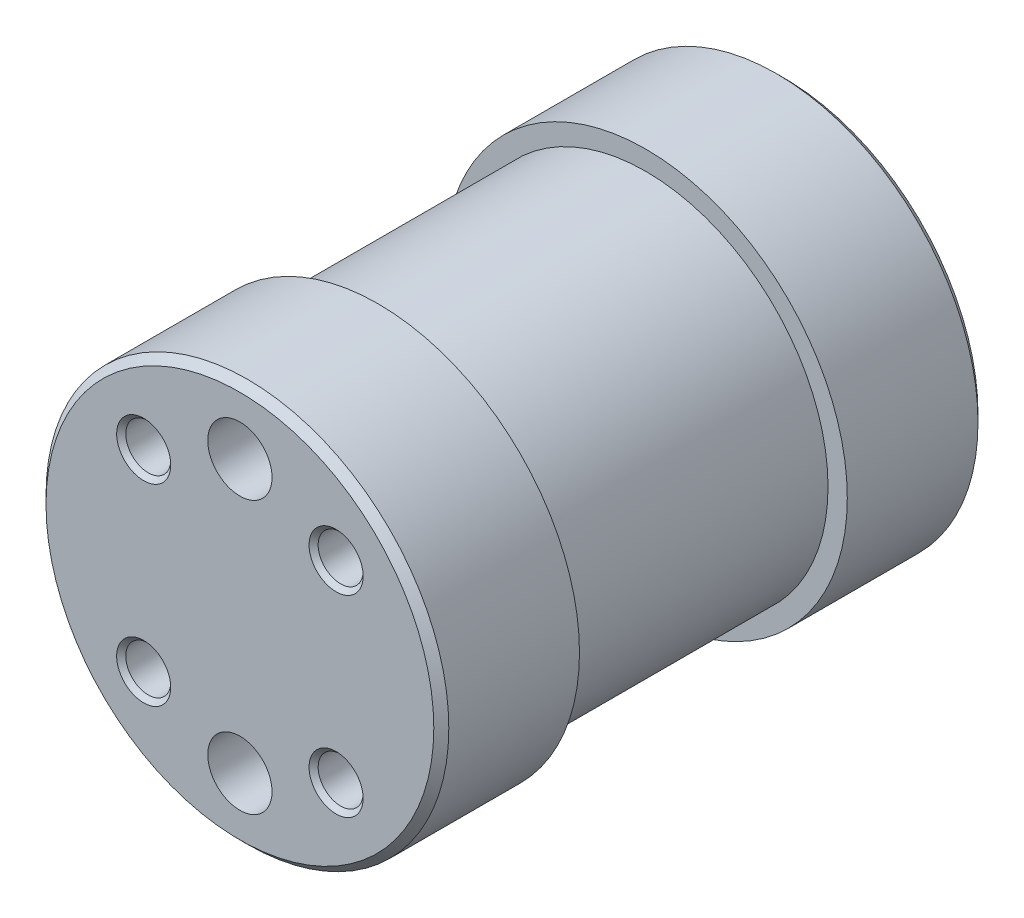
ISO-10303-21;
HEADER;
FILE_DESCRIPTION(('STEP AP214'),'2;1');
FILE_NAME('part.step','',(''),(''),'','','');
FILE_SCHEMA(('AUTOMOTIVE_DESIGN { 1 0 10303 214 1 1 1 1 }'));
ENDSEC;
DATA;
#1=APPLICATION_CONTEXT('core data for automotive mechanical design processes');
#2=APPLICATION_PROTOCOL_DEFINITION('international standard','automotive_design',2000,#1);
#3=PRODUCT_CONTEXT('',#1,'mechanical');
#4=PRODUCT('Part','Part','',(#3));
#5=PRODUCT_RELATED_PRODUCT_CATEGORY('part','',(#4));
#6=PRODUCT_DEFINITION_FORMATION('','',#4);
#7=PRODUCT_DEFINITION_CONTEXT('part definition',#1,'design');
#8=PRODUCT_DEFINITION('design','',#6,#7);
#9=PRODUCT_DEFINITION_SHAPE('','',#8);
#10=(LENGTH_UNIT() NAMED_UNIT(*) SI_UNIT(.MILLI.,.METRE.));
#11=(NAMED_UNIT(*) PLANE_ANGLE_UNIT() SI_UNIT($,.RADIAN.));
#12=(NAMED_UNIT(*) SI_UNIT($,.STERADIAN.) SOLID_ANGLE_UNIT());
#13=UNCERTAINTY_MEASURE_WITH_UNIT(LENGTH_MEASURE(1.E-05),#10,'distance_accuracy_value','');
#14=(GEOMETRIC_REPRESENTATION_CONTEXT(3) GLOBAL_UNCERTAINTY_ASSIGNED_CONTEXT((#13)) GLOBAL_UNIT_ASSIGNED_CONTEXT((#10,
#11,#12)) REPRESENTATION_CONTEXT('',''));
#15=CARTESIAN_POINT('',(0.,0.,0.));
#16=DIRECTION('',(0.,0.,1.));
#17=DIRECTION('',(1.,0.,0.));
#18=AXIS2_PLACEMENT_3D('',#15,#16,#17);
#19=CARTESIAN_POINT('',(18.8,0.,-25.4));
#20=DIRECTION('',(0.,0.,1.));
#21=DIRECTION('',(1.,0.,0.));
#22=AXIS2_PLACEMENT_3D('',#19,#20,#21);
#23=PLANE('',#22);
#24=CARTESIAN_POINT('',(0.,0.,-25.4));
#25=DIRECTION('',(0.,0.,1.));
#26=DIRECTION('',(1.,0.,0.));
#27=AXIS2_PLACEMENT_3D('',#24,#25,#26);
#28=CIRCLE('',#27,18.1);
#29=CARTESIAN_POINT('',(18.1,0.,-25.4));
#30=VERTEX_POINT('',#29);
#31=EDGE_CURVE('E174',#30,#30,#28,.F.);
#32=ORIENTED_EDGE('',*,*,#31,.T.);
#33=EDGE_LOOP('',(#32));
#34=FACE_BOUND('',#33,.T.);
#35=CARTESIAN_POINT('',(-8.9802561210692,-8.98025612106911,-25.4));
#36=DIRECTION('',(0.,0.,-1.));
#37=DIRECTION('',(-1.,0.,0.));
#38=AXIS2_PLACEMENT_3D('',#35,#36,#37);
#39=CIRCLE('',#38,2.525);
#40=CARTESIAN_POINT('',(-11.5052561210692,-8.98025612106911,-25.4));
#41=VERTEX_POINT('',#40);
#42=EDGE_CURVE('E117',#41,#41,#39,.T.);
#43=ORIENTED_EDGE('',*,*,#42,.F.);
#44=EDGE_LOOP('',(#43));
#45=FACE_BOUND('',#44,.T.);
#46=CARTESIAN_POINT('',(-8.98025612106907,8.98025612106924,-25.4));
#47=DIRECTION('',(0.,0.,-1.));
#48=DIRECTION('',(0.,1.,0.));
#49=AXIS2_PLACEMENT_3D('',#46,#47,#48);
#50=CIRCLE('',#49,2.525);
#51=CARTESIAN_POINT('',(-8.98025612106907,11.5052561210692,-25.4));
#52=VERTEX_POINT('',#51);
#53=EDGE_CURVE('E108',#52,#52,#50,.T.);
#54=ORIENTED_EDGE('',*,*,#53,.F.);
#55=EDGE_LOOP('',(#54));
#56=FACE_BOUND('',#55,.T.);
#57=CARTESIAN_POINT('',(8.98025612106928,8.98025612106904,-25.4));
#58=DIRECTION('',(0.,0.,-1.));
#59=DIRECTION('',(0.,1.,0.));
#60=AXIS2_PLACEMENT_3D('',#57,#58,#59);
#61=CIRCLE('',#60,2.525);
#62=CARTESIAN_POINT('',(8.98025612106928,11.505256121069,-25.4));
#63=VERTEX_POINT('',#62);
#64=EDGE_CURVE('E92',#63,#63,#61,.T.);
#65=ORIENTED_EDGE('',*,*,#64,.F.);
#66=EDGE_LOOP('',(#65));
#67=FACE_BOUND('',#66,.T.);
#68=CARTESIAN_POINT('',(8.98025612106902,-8.9802561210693,-25.4));
#69=DIRECTION('',(0.,0.,-1.));
#70=DIRECTION('',(0.,1.,0.));
#71=AXIS2_PLACEMENT_3D('',#68,#69,#70);
#72=CIRCLE('',#71,2.525);
#73=CARTESIAN_POINT('',(8.98025612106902,-6.4552561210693,-25.4));
#74=VERTEX_POINT('',#73);
#75=EDGE_CURVE('E99',#74,#74,#72,.T.);
#76=ORIENTED_EDGE('',*,*,#75,.F.);
#77=EDGE_LOOP('',(#76));
#78=FACE_BOUND('',#77,.T.);
#79=CARTESIAN_POINT('',(0.,-12.7,-25.4));
#80=DIRECTION('',(0.,0.,-1.));
#81=DIRECTION('',(1.,0.,0.));
#82=AXIS2_PLACEMENT_3D('',#79,#80,#81);
#83=CIRCLE('',#82,3.);
#84=CARTESIAN_POINT('',(3.,-12.7,-25.4));
#85=VERTEX_POINT('',#84);
#86=EDGE_CURVE('E345',#85,#85,#83,.T.);
#87=ORIENTED_EDGE('',*,*,#86,.F.);
#88=EDGE_LOOP('',(#87));
#89=FACE_BOUND('',#88,.T.);
#90=CARTESIAN_POINT('',(0.,12.7,-25.4));
#91=DIRECTION('',(0.,0.,1.));
#92=DIRECTION('',(1.,0.,0.));
#93=AXIS2_PLACEMENT_3D('',#90,#91,#92);
#94=CIRCLE('',#93,3.);
#95=CARTESIAN_POINT('',(3.,12.7,-25.4));
#96=VERTEX_POINT('',#95);
#97=EDGE_CURVE('E346',#96,#96,#94,.T.);
#98=ORIENTED_EDGE('',*,*,#97,.T.);
#99=EDGE_LOOP('',(#98));
#100=FACE_BOUND('',#99,.T.);
#101=ADVANCED_FACE('F49',(#34,#45,#56,#67,#78,#89,#100),#23,.F.);
#102=CARTESIAN_POINT('',(0.,0.,25.4));
#103=DIRECTION('',(0.,0.,-1.));
#104=DIRECTION('',(-1.,0.,0.));
#105=AXIS2_PLACEMENT_3D('',#102,#103,#104);
#106=PLANE('',#105);
#107=CARTESIAN_POINT('',(0.,0.,25.4));
#108=DIRECTION('',(0.,0.,-1.));
#109=DIRECTION('',(-1.,0.,0.));
#110=AXIS2_PLACEMENT_3D('',#107,#108,#109);
#111=CIRCLE('',#110,18.1);
#112=CARTESIAN_POINT('',(-18.1,0.,25.4));
#113=VERTEX_POINT('',#112);
#114=EDGE_CURVE('E13',#113,#113,#111,.F.);
#115=ORIENTED_EDGE('',*,*,#114,.T.);
#116=EDGE_LOOP('',(#115));
#117=FACE_BOUND('',#116,.T.);
#118=CARTESIAN_POINT('',(-8.9802561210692,-8.98025612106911,25.4));
#119=DIRECTION('',(0.,0.,1.));
#120=DIRECTION('',(1.,0.,0.));
#121=AXIS2_PLACEMENT_3D('',#118,#119,#120);
#122=CIRCLE('',#121,2.525);
#123=CARTESIAN_POINT('',(-6.4552561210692,-8.98025612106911,25.4));
#124=VERTEX_POINT('',#123);
#125=EDGE_CURVE('E153',#124,#124,#122,.T.);
#126=ORIENTED_EDGE('',*,*,#125,.F.);
#127=EDGE_LOOP('',(#126));
#128=FACE_BOUND('',#127,.T.);
#129=CARTESIAN_POINT('',(-8.98025612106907,8.98025612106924,25.4));
#130=DIRECTION('',(0.,0.,1.));
#131=DIRECTION('',(0.,-1.,0.));
#132=AXIS2_PLACEMENT_3D('',#129,#130,#131);
#133=CIRCLE('',#132,2.525);
#134=CARTESIAN_POINT('',(-8.98025612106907,6.45525612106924,25.4));
#135=VERTEX_POINT('',#134);
#136=EDGE_CURVE('E144',#135,#135,#133,.T.);
#137=ORIENTED_EDGE('',*,*,#136,.F.);
#138=EDGE_LOOP('',(#137));
#139=FACE_BOUND('',#138,.T.);
#140=CARTESIAN_POINT('',(8.98025612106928,8.98025612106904,25.4));
#141=DIRECTION('',(0.,0.,1.));
#142=DIRECTION('',(0.,-1.,0.));
#143=AXIS2_PLACEMENT_3D('',#140,#141,#142);
#144=CIRCLE('',#143,2.525);
#145=CARTESIAN_POINT('',(8.98025612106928,6.45525612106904,25.4));
#146=VERTEX_POINT('',#145);
#147=EDGE_CURVE('E135',#146,#146,#144,.T.);
#148=ORIENTED_EDGE('',*,*,#147,.F.);
#149=EDGE_LOOP('',(#148));
#150=FACE_BOUND('',#149,.T.);
#151=CARTESIAN_POINT('',(8.98025612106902,-8.9802561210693,25.4));
#152=DIRECTION('',(0.,0.,1.));
#153=DIRECTION('',(0.,-1.,0.));
#154=AXIS2_PLACEMENT_3D('',#151,#152,#153);
#155=CIRCLE('',#154,2.525);
#156=CARTESIAN_POINT('',(8.98025612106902,-11.5052561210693,25.4));
#157=VERTEX_POINT('',#156);
#158=EDGE_CURVE('E126',#157,#157,#155,.T.);
#159=ORIENTED_EDGE('',*,*,#158,.F.);
#160=EDGE_LOOP('',(#159));
#161=FACE_BOUND('',#160,.T.);
#162=CARTESIAN_POINT('',(0.,12.7,25.4));
#163=DIRECTION('',(0.,0.,1.));
#164=DIRECTION('',(1.,0.,0.));
#165=AXIS2_PLACEMENT_3D('',#162,#163,#164);
#166=CIRCLE('',#165,3.);
#167=CARTESIAN_POINT('',(3.,12.7,25.4));
#168=VERTEX_POINT('',#167);
#169=EDGE_CURVE('E360',#168,#168,#166,.T.);
#170=ORIENTED_EDGE('',*,*,#169,.F.);
#171=EDGE_LOOP('',(#170));
#172=FACE_BOUND('',#171,.T.);
#173=CARTESIAN_POINT('',(0.,-12.7,25.4));
#174=DIRECTION('',(0.,0.,-1.));
#175=DIRECTION('',(1.,0.,0.));
#176=AXIS2_PLACEMENT_3D('',#173,#174,#175);
#177=CIRCLE('',#176,3.);
#178=CARTESIAN_POINT('',(3.,-12.7,25.4));
#179=VERTEX_POINT('',#178);
#180=EDGE_CURVE('E355',#179,#179,#177,.T.);
#181=ORIENTED_EDGE('',*,*,#180,.T.);
#182=EDGE_LOOP('',(#181));
#183=FACE_BOUND('',#182,.T.);
#184=ADVANCED_FACE('F199',(#117,#128,#139,#150,#161,#172,#183),#106,.F.);
#185=CARTESIAN_POINT('',(0.,0.,-25.4));
#186=DIRECTION('',(0.,0.,-1.));
#187=DIRECTION('',(-1.,0.,0.));
#188=AXIS2_PLACEMENT_3D('',#185,#186,#187);
#189=CYLINDRICAL_SURFACE('',#188,18.8);
#190=CARTESIAN_POINT('',(0.,0.,24.7));
#191=DIRECTION('',(0.,0.,-1.));
#192=DIRECTION('',(-1.,0.,0.));
#193=AXIS2_PLACEMENT_3D('',#190,#191,#192);
#194=CIRCLE('',#193,18.8);
#195=CARTESIAN_POINT('',(-18.8,0.,24.7));
#196=VERTEX_POINT('',#195);
#197=EDGE_CURVE('E57',#196,#196,#194,.T.);
#198=ORIENTED_EDGE('',*,*,#197,.T.);
#199=EDGE_LOOP('',(#198));
#200=FACE_BOUND('',#199,.T.);
#201=CARTESIAN_POINT('',(0.,0.,12.5));
#202=DIRECTION('',(0.,0.,-1.));
#203=DIRECTION('',(-1.,0.,0.));
#204=AXIS2_PLACEMENT_3D('',#201,#202,#203);
#205=CIRCLE('',#204,18.8);
#206=CARTESIAN_POINT('',(-18.8,0.,12.5));
#207=VERTEX_POINT('',#206);
#208=EDGE_CURVE('E171',#207,#207,#205,.T.);
#209=ORIENTED_EDGE('',*,*,#208,.F.);
#210=EDGE_LOOP('',(#209));
#211=FACE_BOUND('',#210,.T.);
#212=ADVANCED_FACE('F182',(#200,#211),#189,.T.);
#213=CARTESIAN_POINT('',(18.8,0.,12.5));
#214=DIRECTION('',(0.,0.,1.));
#215=DIRECTION('',(1.,0.,0.));
#216=AXIS2_PLACEMENT_3D('',#213,#214,#215);
#217=PLANE('',#216);
#218=CARTESIAN_POINT('',(0.,0.,12.5));
#219=DIRECTION('',(0.,0.,-1.));
#220=DIRECTION('',(-1.,0.,0.));
#221=AXIS2_PLACEMENT_3D('',#218,#219,#220);
#222=CIRCLE('',#221,17.);
#223=CARTESIAN_POINT('',(-17.,0.,12.5));
#224=VERTEX_POINT('',#223);
#225=EDGE_CURVE('E168',#224,#224,#222,.T.);
#226=ORIENTED_EDGE('',*,*,#225,.F.);
#227=EDGE_LOOP('',(#226));
#228=FACE_BOUND('',#227,.T.);
#229=ORIENTED_EDGE('',*,*,#208,.T.);
#230=EDGE_LOOP('',(#229));
#231=FACE_BOUND('',#230,.T.);
#232=ADVANCED_FACE('F211',(#228,#231),#217,.F.);
#233=CARTESIAN_POINT('',(0.,0.,-25.4));
#234=DIRECTION('',(0.,0.,-1.));
#235=DIRECTION('',(-1.,0.,0.));
#236=AXIS2_PLACEMENT_3D('',#233,#234,#235);
#237=CYLINDRICAL_SURFACE('',#236,17.);
#238=CARTESIAN_POINT('',(0.,0.,-12.5));
#239=DIRECTION('',(0.,0.,-1.));
#240=DIRECTION('',(-1.,0.,0.));
#241=AXIS2_PLACEMENT_3D('',#238,#239,#240);
#242=CIRCLE('',#241,17.);
#243=CARTESIAN_POINT('',(-17.,0.,-12.5));
#244=VERTEX_POINT('',#243);
#245=EDGE_CURVE('E165',#244,#244,#242,.T.);
#246=ORIENTED_EDGE('',*,*,#245,.F.);
#247=EDGE_LOOP('',(#246));
#248=FACE_BOUND('',#247,.T.);
#249=ORIENTED_EDGE('',*,*,#225,.T.);
#250=EDGE_LOOP('',(#249));
#251=FACE_BOUND('',#250,.T.);
#252=ADVANCED_FACE('F214',(#248,#251),#237,.T.);
#253=CARTESIAN_POINT('',(17.,0.,-12.5));
#254=DIRECTION('',(0.,0.,-1.));
#255=DIRECTION('',(-1.,0.,0.));
#256=AXIS2_PLACEMENT_3D('',#253,#254,#255);
#257=PLANE('',#256);
#258=CARTESIAN_POINT('',(0.,0.,-12.5));
#259=DIRECTION('',(0.,0.,-1.));
#260=DIRECTION('',(-1.,0.,0.));
#261=AXIS2_PLACEMENT_3D('',#258,#259,#260);
#262=CIRCLE('',#261,18.8);
#263=CARTESIAN_POINT('',(-18.8,0.,-12.5));
#264=VERTEX_POINT('',#263);
#265=EDGE_CURVE('E162',#264,#264,#262,.T.);
#266=ORIENTED_EDGE('',*,*,#265,.F.);
#267=EDGE_LOOP('',(#266));
#268=FACE_BOUND('',#267,.T.);
#269=ORIENTED_EDGE('',*,*,#245,.T.);
#270=EDGE_LOOP('',(#269));
#271=FACE_BOUND('',#270,.T.);
#272=ADVANCED_FACE('F218',(#268,#271),#257,.F.);
#273=CARTESIAN_POINT('',(0.,0.,-25.4));
#274=DIRECTION('',(0.,0.,-1.));
#275=DIRECTION('',(-1.,0.,0.));
#276=AXIS2_PLACEMENT_3D('',#273,#274,#275);
#277=CYLINDRICAL_SURFACE('',#276,18.8);
#278=CARTESIAN_POINT('',(0.,0.,-24.7));
#279=DIRECTION('',(0.,0.,1.));
#280=DIRECTION('',(1.,0.,0.));
#281=AXIS2_PLACEMENT_3D('',#278,#279,#280);
#282=CIRCLE('',#281,18.8);
#283=CARTESIAN_POINT('',(18.8,0.,-24.7));
#284=VERTEX_POINT('',#283);
#285=EDGE_CURVE('E177',#284,#284,#282,.T.);
#286=ORIENTED_EDGE('',*,*,#285,.T.);
#287=EDGE_LOOP('',(#286));
#288=FACE_BOUND('',#287,.T.);
#289=ORIENTED_EDGE('',*,*,#265,.T.);
#290=EDGE_LOOP('',(#289));
#291=FACE_BOUND('',#290,.T.);
#292=ADVANCED_FACE('F195',(#288,#291),#277,.T.);
#293=CARTESIAN_POINT('',(0.,0.,-25.4));
#294=DIRECTION('',(0.,0.,1.));
#295=DIRECTION('',(1.,0.,0.));
#296=AXIS2_PLACEMENT_3D('',#293,#294,#295);
#297=CONICAL_SURFACE('',#296,18.1,0.785398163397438);
#298=ORIENTED_EDGE('',*,*,#285,.F.);
#299=EDGE_LOOP('',(#298));
#300=FACE_BOUND('',#299,.T.);
#301=ORIENTED_EDGE('',*,*,#31,.F.);
#302=EDGE_LOOP('',(#301));
#303=FACE_BOUND('',#302,.T.);
#304=ADVANCED_FACE('F187',(#300,#303),#297,.T.);
#305=CARTESIAN_POINT('',(0.,0.,24.7));
#306=DIRECTION('',(0.,0.,-1.));
#307=DIRECTION('',(-1.,0.,0.));
#308=AXIS2_PLACEMENT_3D('',#305,#306,#307);
#309=CONICAL_SURFACE('',#308,18.8,0.785398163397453);
#310=CARTESIAN_POINT('',(-18.1,0.,25.4));
#311=CARTESIAN_POINT('',(-18.1072916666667,0.,25.3927083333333));
#312=CARTESIAN_POINT('',(-18.1145833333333,0.,25.3854166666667));
#313=CARTESIAN_POINT('',(-18.1291666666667,0.,25.3708333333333));
#314=CARTESIAN_POINT('',(-18.1364583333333,0.,25.3635416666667));
#315=CARTESIAN_POINT('',(-18.1510416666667,0.,25.3489583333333));
#316=CARTESIAN_POINT('',(-18.1583333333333,0.,25.3416666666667));
#317=CARTESIAN_POINT('',(-18.1729166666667,0.,25.3270833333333));
#318=CARTESIAN_POINT('',(-18.1802083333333,0.,25.3197916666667));
#319=CARTESIAN_POINT('',(-18.1947916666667,0.,25.3052083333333));
#320=CARTESIAN_POINT('',(-18.2020833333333,0.,25.2979166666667));
#321=CARTESIAN_POINT('',(-18.2166666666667,0.,25.2833333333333));
#322=CARTESIAN_POINT('',(-18.2239583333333,0.,25.2760416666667));
#323=CARTESIAN_POINT('',(-18.2385416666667,0.,25.2614583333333));
#324=CARTESIAN_POINT('',(-18.2458333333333,0.,25.2541666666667));
#325=CARTESIAN_POINT('',(-18.2604166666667,0.,25.2395833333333));
#326=CARTESIAN_POINT('',(-18.2677083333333,0.,25.2322916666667));
#327=CARTESIAN_POINT('',(-18.2822916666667,0.,25.2177083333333));
#328=CARTESIAN_POINT('',(-18.2895833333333,0.,25.2104166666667));
#329=CARTESIAN_POINT('',(-18.3041666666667,0.,25.1958333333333));
#330=CARTESIAN_POINT('',(-18.3114583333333,0.,25.1885416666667));
#331=CARTESIAN_POINT('',(-18.3260416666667,0.,25.1739583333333));
#332=CARTESIAN_POINT('',(-18.3333333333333,0.,25.1666666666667));
#333=CARTESIAN_POINT('',(-18.3479166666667,0.,25.1520833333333));
#334=CARTESIAN_POINT('',(-18.3552083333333,0.,25.1447916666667));
#335=CARTESIAN_POINT('',(-18.3697916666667,0.,25.1302083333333));
#336=CARTESIAN_POINT('',(-18.3770833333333,0.,25.1229166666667));
#337=CARTESIAN_POINT('',(-18.3916666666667,0.,25.1083333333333));
#338=CARTESIAN_POINT('',(-18.3989583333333,0.,25.1010416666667));
#339=CARTESIAN_POINT('',(-18.4135416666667,0.,25.0864583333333));
#340=CARTESIAN_POINT('',(-18.4208333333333,0.,25.0791666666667));
#341=CARTESIAN_POINT('',(-18.4354166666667,0.,25.0645833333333));
#342=CARTESIAN_POINT('',(-18.4427083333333,0.,25.0572916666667));
#343=CARTESIAN_POINT('',(-18.4572916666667,0.,25.0427083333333));
#344=CARTESIAN_POINT('',(-18.4645833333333,0.,25.0354166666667));
#345=CARTESIAN_POINT('',(-18.4791666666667,0.,25.0208333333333));
#346=CARTESIAN_POINT('',(-18.4864583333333,0.,25.0135416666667));
#347=CARTESIAN_POINT('',(-18.5010416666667,0.,24.9989583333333));
#348=CARTESIAN_POINT('',(-18.5083333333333,0.,24.9916666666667));
#349=CARTESIAN_POINT('',(-18.5229166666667,0.,24.9770833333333));
#350=CARTESIAN_POINT('',(-18.5302083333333,0.,24.9697916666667));
#351=CARTESIAN_POINT('',(-18.5447916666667,0.,24.9552083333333));
#352=CARTESIAN_POINT('',(-18.5520833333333,0.,24.9479166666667));
#353=CARTESIAN_POINT('',(-18.5666666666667,0.,24.9333333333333));
#354=CARTESIAN_POINT('',(-18.5739583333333,0.,24.9260416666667));
#355=CARTESIAN_POINT('',(-18.5885416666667,0.,24.9114583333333));
#356=CARTESIAN_POINT('',(-18.5958333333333,0.,24.9041666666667));
#357=CARTESIAN_POINT('',(-18.6104166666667,0.,24.8895833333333));
#358=CARTESIAN_POINT('',(-18.6177083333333,0.,24.8822916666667));
#359=CARTESIAN_POINT('',(-18.6322916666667,0.,24.8677083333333));
#360=CARTESIAN_POINT('',(-18.6395833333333,0.,24.8604166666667));
#361=CARTESIAN_POINT('',(-18.6541666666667,0.,24.8458333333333));
#362=CARTESIAN_POINT('',(-18.6614583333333,0.,24.8385416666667));
#363=CARTESIAN_POINT('',(-18.6760416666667,0.,24.8239583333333));
#364=CARTESIAN_POINT('',(-18.6833333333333,0.,24.8166666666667));
#365=CARTESIAN_POINT('',(-18.6979166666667,0.,24.8020833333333));
#366=CARTESIAN_POINT('',(-18.7052083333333,0.,24.7947916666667));
#367=CARTESIAN_POINT('',(-18.7197916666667,0.,24.7802083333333));
#368=CARTESIAN_POINT('',(-18.7270833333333,0.,24.7729166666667));
#369=CARTESIAN_POINT('',(-18.7416666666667,0.,24.7583333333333));
#370=CARTESIAN_POINT('',(-18.7489583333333,0.,24.7510416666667));
#371=CARTESIAN_POINT('',(-18.7635416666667,0.,24.7364583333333));
#372=CARTESIAN_POINT('',(-18.7708333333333,0.,24.7291666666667));
#373=CARTESIAN_POINT('',(-18.7854166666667,0.,24.7145833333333));
#374=CARTESIAN_POINT('',(-18.7927083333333,0.,24.7072916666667));
#375=CARTESIAN_POINT('',(-18.8,0.,24.7));
#376=B_SPLINE_CURVE_WITH_KNOTS('',3,(#310,#311,#312,#313,#314,#315,#316,#317,#318,#319,#320,
#321,#322,#323,#324,#325,#326,#327,#328,#329,#330,#331,#332,#333,#334,#335,#336,#337,#338,#339,
#340,#341,#342,#343,#344,#345,#346,#347,#348,#349,#350,#351,#352,#353,#354,#355,#356,#357,#358,
#359,#360,#361,#362,#363,#364,#365,#366,#367,#368,#369,#370,#371,#372,#373,#374,#375),
.UNSPECIFIED.,.F.,.F.,(4,2,2,2,2,2,2,2,2,2,2,2,2,2,2,2,2,2,2,2,2,2,2,2,2,2,2,2,2,2,2,2,4),(0.,
0.030935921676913,0.0618718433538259,0.0928077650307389,0.123743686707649,0.15467960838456,
0.185615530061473,0.216551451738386,0.247487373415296,0.278423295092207,0.30935921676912,
0.34029513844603,0.371231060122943,0.402166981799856,0.433102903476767,0.464038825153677,
0.49497474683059,0.525910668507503,0.556846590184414,0.587782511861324,0.618718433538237,
0.64965435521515,0.68059027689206,0.711526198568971,0.742462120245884,0.773398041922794,
0.804333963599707,0.83526988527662,0.866205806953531,0.897141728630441,0.928077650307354,
0.959013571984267,0.989949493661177),.UNSPECIFIED.);
#377=EDGE_CURVE('BSEAM51',#113,#196,#376,.T.);
#378=ORIENTED_EDGE('',*,*,#114,.F.);
#379=ORIENTED_EDGE('',*,*,#197,.F.);
#380=ORIENTED_EDGE('',*,*,#377,.T.);
#381=ORIENTED_EDGE('',*,*,#377,.F.);
#382=EDGE_LOOP('',(#378,#380,#379,#381));
#383=FACE_BOUND('',#382,.T.);
#384=ADVANCED_FACE('F51',(#383),#309,.T.);
#385=CARTESIAN_POINT('',(-8.9802561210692,-8.98025612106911,11.4));
#386=DIRECTION('',(0.,0.,1.));
#387=DIRECTION('',(1.,0.,0.));
#388=AXIS2_PLACEMENT_3D('',#385,#386,#387);
#389=CONICAL_SURFACE('',#388,2.1,1.02974425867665);
#390=CARTESIAN_POINT('',(-8.9802561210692,-8.98025612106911,10.1381927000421));
#391=VERTEX_POINT('',#390);
#392=VERTEX_LOOP('',#391);
#393=FACE_BOUND('',#392,.T.);
#394=CARTESIAN_POINT('',(-8.9802561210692,-8.98025612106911,11.4));
#395=DIRECTION('',(0.,0.,1.));
#396=DIRECTION('',(1.,0.,0.));
#397=AXIS2_PLACEMENT_3D('',#394,#395,#396);
#398=CIRCLE('',#397,2.1);
#399=CARTESIAN_POINT('',(-6.8802561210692,-8.98025612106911,11.4));
#400=VERTEX_POINT('',#399);
#401=EDGE_CURVE('E159',#400,#400,#398,.T.);
#402=ORIENTED_EDGE('',*,*,#401,.T.);
#403=EDGE_LOOP('',(#402));
#404=FACE_BOUND('',#403,.T.);
#405=ADVANCED_FACE('F186',(#393,#404),#389,.F.);
#406=CARTESIAN_POINT('',(-8.9802561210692,-8.98025612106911,25.4));
#407=DIRECTION('',(0.,0.,1.));
#408=DIRECTION('',(1.,0.,0.));
#409=AXIS2_PLACEMENT_3D('',#406,#407,#408);
#410=CYLINDRICAL_SURFACE('',#409,2.1);
#411=ORIENTED_EDGE('',*,*,#401,.F.);
#412=EDGE_LOOP('',(#411));
#413=FACE_BOUND('',#412,.T.);
#414=CARTESIAN_POINT('',(-8.9802561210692,-8.98025612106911,24.975));
#415=DIRECTION('',(0.,0.,1.));
#416=DIRECTION('',(1.,0.,0.));
#417=AXIS2_PLACEMENT_3D('',#414,#415,#416);
#418=CIRCLE('',#417,2.1);
#419=CARTESIAN_POINT('',(-6.8802561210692,-8.98025612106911,24.975));
#420=VERTEX_POINT('',#419);
#421=EDGE_CURVE('E156',#420,#420,#418,.T.);
#422=ORIENTED_EDGE('',*,*,#421,.T.);
#423=EDGE_LOOP('',(#422));
#424=FACE_BOUND('',#423,.T.);
#425=ADVANCED_FACE('F193',(#413,#424),#410,.F.);
#426=CARTESIAN_POINT('',(-8.9802561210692,-8.98025612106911,25.4));
#427=DIRECTION('',(0.,0.,1.));
#428=DIRECTION('',(1.,0.,0.));
#429=AXIS2_PLACEMENT_3D('',#426,#427,#428);
#430=CONICAL_SURFACE('',#429,2.525,0.78539816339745);
#431=ORIENTED_EDGE('',*,*,#421,.F.);
#432=EDGE_LOOP('',(#431));
#433=FACE_BOUND('',#432,.T.);
#434=ORIENTED_EDGE('',*,*,#125,.T.);
#435=EDGE_LOOP('',(#434));
#436=FACE_BOUND('',#435,.T.);
#437=ADVANCED_FACE('F228',(#433,#436),#430,.F.);
#438=CARTESIAN_POINT('',(-8.98025612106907,8.98025612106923,11.4));
#439=DIRECTION('',(0.,0.,1.));
#440=DIRECTION('',(0.,-1.,0.));
#441=AXIS2_PLACEMENT_3D('',#438,#439,#440);
#442=CONICAL_SURFACE('',#441,2.1,1.02974425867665);
#443=CARTESIAN_POINT('',(-8.98025612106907,8.98025612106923,10.1381927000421));
#444=VERTEX_POINT('',#443);
#445=VERTEX_LOOP('',#444);
#446=FACE_BOUND('',#445,.T.);
#447=CARTESIAN_POINT('',(-8.98025612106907,8.98025612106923,11.4));
#448=DIRECTION('',(0.,0.,1.));
#449=DIRECTION('',(0.,-1.,0.));
#450=AXIS2_PLACEMENT_3D('',#447,#448,#449);
#451=CIRCLE('',#450,2.1);
#452=CARTESIAN_POINT('',(-8.98025612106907,6.88025612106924,11.4));
#453=VERTEX_POINT('',#452);
#454=EDGE_CURVE('E150',#453,#453,#451,.T.);
#455=ORIENTED_EDGE('',*,*,#454,.T.);
#456=EDGE_LOOP('',(#455));
#457=FACE_BOUND('',#456,.T.);
#458=ADVANCED_FACE('F232',(#446,#457),#442,.F.);
#459=CARTESIAN_POINT('',(-8.98025612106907,8.98025612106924,25.4));
#460=DIRECTION('',(0.,0.,1.));
#461=DIRECTION('',(0.,-1.,0.));
#462=AXIS2_PLACEMENT_3D('',#459,#460,#461);
#463=CYLINDRICAL_SURFACE('',#462,2.1);
#464=ORIENTED_EDGE('',*,*,#454,.F.);
#465=EDGE_LOOP('',(#464));
#466=FACE_BOUND('',#465,.T.);
#467=CARTESIAN_POINT('',(-8.98025612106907,8.98025612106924,24.975));
#468=DIRECTION('',(0.,0.,1.));
#469=DIRECTION('',(0.,-1.,0.));
#470=AXIS2_PLACEMENT_3D('',#467,#468,#469);
#471=CIRCLE('',#470,2.1);
#472=CARTESIAN_POINT('',(-8.98025612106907,6.88025612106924,24.975));
#473=VERTEX_POINT('',#472);
#474=EDGE_CURVE('E147',#473,#473,#471,.T.);
#475=ORIENTED_EDGE('',*,*,#474,.T.);
#476=EDGE_LOOP('',(#475));
#477=FACE_BOUND('',#476,.T.);
#478=ADVANCED_FACE('F236',(#466,#477),#463,.F.);
#479=CARTESIAN_POINT('',(-8.98025612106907,8.98025612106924,25.4));
#480=DIRECTION('',(0.,0.,1.));
#481=DIRECTION('',(0.,-1.,0.));
#482=AXIS2_PLACEMENT_3D('',#479,#480,#481);
#483=CONICAL_SURFACE('',#482,2.525,0.78539816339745);
#484=ORIENTED_EDGE('',*,*,#474,.F.);
#485=EDGE_LOOP('',(#484));
#486=FACE_BOUND('',#485,.T.);
#487=ORIENTED_EDGE('',*,*,#136,.T.);
#488=EDGE_LOOP('',(#487));
#489=FACE_BOUND('',#488,.T.);
#490=ADVANCED_FACE('F239',(#486,#489),#483,.F.);
#491=CARTESIAN_POINT('',(8.98025612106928,8.98025612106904,11.4));
#492=DIRECTION('',(0.,0.,1.));
#493=DIRECTION('',(0.,-1.,0.));
#494=AXIS2_PLACEMENT_3D('',#491,#492,#493);
#495=CONICAL_SURFACE('',#494,2.1,1.02974425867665);
#496=CARTESIAN_POINT('',(8.98025612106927,8.98025612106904,10.1381927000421));
#497=VERTEX_POINT('',#496);
#498=VERTEX_LOOP('',#497);
#499=FACE_BOUND('',#498,.T.);
#500=CARTESIAN_POINT('',(8.98025612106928,8.98025612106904,11.4));
#501=DIRECTION('',(0.,0.,1.));
#502=DIRECTION('',(0.,-1.,0.));
#503=AXIS2_PLACEMENT_3D('',#500,#501,#502);
#504=CIRCLE('',#503,2.1);
#505=CARTESIAN_POINT('',(8.98025612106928,6.88025612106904,11.4));
#506=VERTEX_POINT('',#505);
#507=EDGE_CURVE('E141',#506,#506,#504,.T.);
#508=ORIENTED_EDGE('',*,*,#507,.T.);
#509=EDGE_LOOP('',(#508));
#510=FACE_BOUND('',#509,.T.);
#511=ADVANCED_FACE('F243',(#499,#510),#495,.F.);
#512=CARTESIAN_POINT('',(8.98025612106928,8.98025612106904,25.4));
#513=DIRECTION('',(0.,0.,1.));
#514=DIRECTION('',(0.,-1.,0.));
#515=AXIS2_PLACEMENT_3D('',#512,#513,#514);
#516=CYLINDRICAL_SURFACE('',#515,2.1);
#517=ORIENTED_EDGE('',*,*,#507,.F.);
#518=EDGE_LOOP('',(#517));
#519=FACE_BOUND('',#518,.T.);
#520=CARTESIAN_POINT('',(8.98025612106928,8.98025612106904,24.975));
#521=DIRECTION('',(0.,0.,1.));
#522=DIRECTION('',(0.,-1.,0.));
#523=AXIS2_PLACEMENT_3D('',#520,#521,#522);
#524=CIRCLE('',#523,2.1);
#525=CARTESIAN_POINT('',(8.98025612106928,6.88025612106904,24.975));
#526=VERTEX_POINT('',#525);
#527=EDGE_CURVE('E138',#526,#526,#524,.T.);
#528=ORIENTED_EDGE('',*,*,#527,.T.);
#529=EDGE_LOOP('',(#528));
#530=FACE_BOUND('',#529,.T.);
#531=ADVANCED_FACE('F247',(#519,#530),#516,.F.);
#532=CARTESIAN_POINT('',(8.98025612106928,8.98025612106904,25.4));
#533=DIRECTION('',(0.,0.,1.));
#534=DIRECTION('',(0.,-1.,0.));
#535=AXIS2_PLACEMENT_3D('',#532,#533,#534);
#536=CONICAL_SURFACE('',#535,2.525,0.78539816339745);
#537=ORIENTED_EDGE('',*,*,#527,.F.);
#538=EDGE_LOOP('',(#537));
#539=FACE_BOUND('',#538,.T.);
#540=ORIENTED_EDGE('',*,*,#147,.T.);
#541=EDGE_LOOP('',(#540));
#542=FACE_BOUND('',#541,.T.);
#543=ADVANCED_FACE('F251',(#539,#542),#536,.F.);
#544=CARTESIAN_POINT('',(8.98025612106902,-8.9802561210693,11.4));
#545=DIRECTION('',(0.,0.,1.));
#546=DIRECTION('',(0.,-1.,0.));
#547=AXIS2_PLACEMENT_3D('',#544,#545,#546);
#548=CONICAL_SURFACE('',#547,2.1,1.02974425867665);
#549=CARTESIAN_POINT('',(8.98025612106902,-8.98025612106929,10.1381927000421));
#550=VERTEX_POINT('',#549);
#551=VERTEX_LOOP('',#550);
#552=FACE_BOUND('',#551,.T.);
#553=CARTESIAN_POINT('',(8.98025612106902,-8.9802561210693,11.4));
#554=DIRECTION('',(0.,0.,1.));
#555=DIRECTION('',(0.,-1.,0.));
#556=AXIS2_PLACEMENT_3D('',#553,#554,#555);
#557=CIRCLE('',#556,2.1);
#558=CARTESIAN_POINT('',(8.98025612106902,-11.0802561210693,11.4));
#559=VERTEX_POINT('',#558);
#560=EDGE_CURVE('E132',#559,#559,#557,.T.);
#561=ORIENTED_EDGE('',*,*,#560,.T.);
#562=EDGE_LOOP('',(#561));
#563=FACE_BOUND('',#562,.T.);
#564=ADVANCED_FACE('F255',(#552,#563),#548,.F.);
#565=CARTESIAN_POINT('',(8.98025612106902,-8.9802561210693,25.4));
#566=DIRECTION('',(0.,0.,1.));
#567=DIRECTION('',(0.,-1.,0.));
#568=AXIS2_PLACEMENT_3D('',#565,#566,#567);
#569=CYLINDRICAL_SURFACE('',#568,2.1);
#570=ORIENTED_EDGE('',*,*,#560,.F.);
#571=EDGE_LOOP('',(#570));
#572=FACE_BOUND('',#571,.T.);
#573=CARTESIAN_POINT('',(8.98025612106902,-8.9802561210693,24.975));
#574=DIRECTION('',(0.,0.,1.));
#575=DIRECTION('',(0.,-1.,0.));
#576=AXIS2_PLACEMENT_3D('',#573,#574,#575);
#577=CIRCLE('',#576,2.1);
#578=CARTESIAN_POINT('',(8.98025612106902,-11.0802561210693,24.975));
#579=VERTEX_POINT('',#578);
#580=EDGE_CURVE('E129',#579,#579,#577,.T.);
#581=ORIENTED_EDGE('',*,*,#580,.T.);
#582=EDGE_LOOP('',(#581));
#583=FACE_BOUND('',#582,.T.);
#584=ADVANCED_FACE('F259',(#572,#583),#569,.F.);
#585=CARTESIAN_POINT('',(8.98025612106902,-8.9802561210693,25.4));
#586=DIRECTION('',(0.,0.,1.));
#587=DIRECTION('',(0.,-1.,0.));
#588=AXIS2_PLACEMENT_3D('',#585,#586,#587);
#589=CONICAL_SURFACE('',#588,2.525,0.78539816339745);
#590=ORIENTED_EDGE('',*,*,#580,.F.);
#591=EDGE_LOOP('',(#590));
#592=FACE_BOUND('',#591,.T.);
#593=ORIENTED_EDGE('',*,*,#158,.T.);
#594=EDGE_LOOP('',(#593));
#595=FACE_BOUND('',#594,.T.);
#596=ADVANCED_FACE('F263',(#592,#595),#589,.F.);
#597=CARTESIAN_POINT('',(-8.9802561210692,-8.98025612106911,-11.4));
#598=DIRECTION('',(0.,0.,-1.));
#599=DIRECTION('',(-1.,0.,0.));
#600=AXIS2_PLACEMENT_3D('',#597,#598,#599);
#601=CONICAL_SURFACE('',#600,2.1,1.02974425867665);
#602=CARTESIAN_POINT('',(-8.9802561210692,-8.98025612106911,-10.1381927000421));
#603=VERTEX_POINT('',#602);
#604=VERTEX_LOOP('',#603);
#605=FACE_BOUND('',#604,.T.);
#606=CARTESIAN_POINT('',(-8.9802561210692,-8.98025612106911,-11.4));
#607=DIRECTION('',(0.,0.,-1.));
#608=DIRECTION('',(-1.,0.,0.));
#609=AXIS2_PLACEMENT_3D('',#606,#607,#608);
#610=CIRCLE('',#609,2.1);
#611=CARTESIAN_POINT('',(-11.0802561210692,-8.98025612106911,-11.4));
#612=VERTEX_POINT('',#611);
#613=EDGE_CURVE('E123',#612,#612,#610,.T.);
#614=ORIENTED_EDGE('',*,*,#613,.T.);
#615=EDGE_LOOP('',(#614));
#616=FACE_BOUND('',#615,.T.);
#617=ADVANCED_FACE('F267',(#605,#616),#601,.F.);
#618=CARTESIAN_POINT('',(-8.9802561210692,-8.98025612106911,-25.4));
#619=DIRECTION('',(0.,0.,-1.));
#620=DIRECTION('',(-1.,0.,0.));
#621=AXIS2_PLACEMENT_3D('',#618,#619,#620);
#622=CYLINDRICAL_SURFACE('',#621,2.1);
#623=ORIENTED_EDGE('',*,*,#613,.F.);
#624=EDGE_LOOP('',(#623));
#625=FACE_BOUND('',#624,.T.);
#626=CARTESIAN_POINT('',(-8.9802561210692,-8.98025612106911,-24.975));
#627=DIRECTION('',(0.,0.,-1.));
#628=DIRECTION('',(-1.,0.,0.));
#629=AXIS2_PLACEMENT_3D('',#626,#627,#628);
#630=CIRCLE('',#629,2.1);
#631=CARTESIAN_POINT('',(-11.0802561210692,-8.98025612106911,-24.975));
#632=VERTEX_POINT('',#631);
#633=EDGE_CURVE('E120',#632,#632,#630,.T.);
#634=ORIENTED_EDGE('',*,*,#633,.T.);
#635=EDGE_LOOP('',(#634));
#636=FACE_BOUND('',#635,.T.);
#637=ADVANCED_FACE('F271',(#625,#636),#622,.F.);
#638=CARTESIAN_POINT('',(-8.9802561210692,-8.98025612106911,-25.4));
#639=DIRECTION('',(0.,0.,-1.));
#640=DIRECTION('',(-1.,0.,0.));
#641=AXIS2_PLACEMENT_3D('',#638,#639,#640);
#642=CONICAL_SURFACE('',#641,2.525,0.78539816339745);
#643=ORIENTED_EDGE('',*,*,#633,.F.);
#644=EDGE_LOOP('',(#643));
#645=FACE_BOUND('',#644,.T.);
#646=ORIENTED_EDGE('',*,*,#42,.T.);
#647=EDGE_LOOP('',(#646));
#648=FACE_BOUND('',#647,.T.);
#649=ADVANCED_FACE('F275',(#645,#648),#642,.F.);
#650=CARTESIAN_POINT('',(-8.98025612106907,8.98025612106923,-11.4));
#651=DIRECTION('',(0.,0.,-1.));
#652=DIRECTION('',(0.,1.,0.));
#653=AXIS2_PLACEMENT_3D('',#650,#651,#652);
#654=CONICAL_SURFACE('',#653,2.1,1.02974425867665);
#655=CARTESIAN_POINT('',(-8.98025612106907,8.98025612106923,-10.1381927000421));
#656=VERTEX_POINT('',#655);
#657=VERTEX_LOOP('',#656);
#658=FACE_BOUND('',#657,.T.);
#659=CARTESIAN_POINT('',(-8.98025612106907,8.98025612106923,-11.4));
#660=DIRECTION('',(0.,0.,-1.));
#661=DIRECTION('',(0.,1.,0.));
#662=AXIS2_PLACEMENT_3D('',#659,#660,#661);
#663=CIRCLE('',#662,2.1);
#664=CARTESIAN_POINT('',(-8.98025612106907,11.0802561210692,-11.4));
#665=VERTEX_POINT('',#664);
#666=EDGE_CURVE('E114',#665,#665,#663,.T.);
#667=ORIENTED_EDGE('',*,*,#666,.T.);
#668=EDGE_LOOP('',(#667));
#669=FACE_BOUND('',#668,.T.);
#670=ADVANCED_FACE('F279',(#658,#669),#654,.F.);
#671=CARTESIAN_POINT('',(-8.98025612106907,8.98025612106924,-25.4));
#672=DIRECTION('',(0.,0.,-1.));
#673=DIRECTION('',(0.,1.,0.));
#674=AXIS2_PLACEMENT_3D('',#671,#672,#673);
#675=CYLINDRICAL_SURFACE('',#674,2.1);
#676=ORIENTED_EDGE('',*,*,#666,.F.);
#677=EDGE_LOOP('',(#676));
#678=FACE_BOUND('',#677,.T.);
#679=CARTESIAN_POINT('',(-8.98025612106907,8.98025612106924,-24.975));
#680=DIRECTION('',(0.,0.,-1.));
#681=DIRECTION('',(0.,1.,0.));
#682=AXIS2_PLACEMENT_3D('',#679,#680,#681);
#683=CIRCLE('',#682,2.1);
#684=CARTESIAN_POINT('',(-8.98025612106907,11.0802561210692,-24.975));
#685=VERTEX_POINT('',#684);
#686=EDGE_CURVE('E111',#685,#685,#683,.T.);
#687=ORIENTED_EDGE('',*,*,#686,.T.);
#688=EDGE_LOOP('',(#687));
#689=FACE_BOUND('',#688,.T.);
#690=ADVANCED_FACE('F283',(#678,#689),#675,.F.);
#691=CARTESIAN_POINT('',(-8.98025612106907,8.98025612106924,-25.4));
#692=DIRECTION('',(0.,0.,-1.));
#693=DIRECTION('',(0.,1.,0.));
#694=AXIS2_PLACEMENT_3D('',#691,#692,#693);
#695=CONICAL_SURFACE('',#694,2.525,0.78539816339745);
#696=ORIENTED_EDGE('',*,*,#686,.F.);
#697=EDGE_LOOP('',(#696));
#698=FACE_BOUND('',#697,.T.);
#699=ORIENTED_EDGE('',*,*,#53,.T.);
#700=EDGE_LOOP('',(#699));
#701=FACE_BOUND('',#700,.T.);
#702=ADVANCED_FACE('F287',(#698,#701),#695,.F.);
#703=CARTESIAN_POINT('',(8.98025612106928,8.98025612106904,-11.4));
#704=DIRECTION('',(0.,0.,-1.));
#705=DIRECTION('',(0.,1.,0.));
#706=AXIS2_PLACEMENT_3D('',#703,#704,#705);
#707=CONICAL_SURFACE('',#706,2.1,1.02974425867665);
#708=CARTESIAN_POINT('',(8.98025612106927,8.98025612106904,-10.1381927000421));
#709=VERTEX_POINT('',#708);
#710=VERTEX_LOOP('',#709);
#711=FACE_BOUND('',#710,.T.);
#712=CARTESIAN_POINT('',(8.98025612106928,8.98025612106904,-11.4));
#713=DIRECTION('',(0.,0.,-1.));
#714=DIRECTION('',(0.,1.,0.));
#715=AXIS2_PLACEMENT_3D('',#712,#713,#714);
#716=CIRCLE('',#715,2.1);
#717=CARTESIAN_POINT('',(8.98025612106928,11.080256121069,-11.4));
#718=VERTEX_POINT('',#717);
#719=EDGE_CURVE('E105',#718,#718,#716,.T.);
#720=ORIENTED_EDGE('',*,*,#719,.T.);
#721=EDGE_LOOP('',(#720));
#722=FACE_BOUND('',#721,.T.);
#723=ADVANCED_FACE('F291',(#711,#722),#707,.F.);
#724=CARTESIAN_POINT('',(8.98025612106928,8.98025612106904,-25.4));
#725=DIRECTION('',(0.,0.,-1.));
#726=DIRECTION('',(0.,1.,0.));
#727=AXIS2_PLACEMENT_3D('',#724,#725,#726);
#728=CYLINDRICAL_SURFACE('',#727,2.1);
#729=ORIENTED_EDGE('',*,*,#719,.F.);
#730=EDGE_LOOP('',(#729));
#731=FACE_BOUND('',#730,.T.);
#732=CARTESIAN_POINT('',(8.98025612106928,8.98025612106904,-24.975));
#733=DIRECTION('',(0.,0.,-1.));
#734=DIRECTION('',(0.,1.,0.));
#735=AXIS2_PLACEMENT_3D('',#732,#733,#734);
#736=CIRCLE('',#735,2.1);
#737=CARTESIAN_POINT('',(8.98025612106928,11.080256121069,-24.975));
#738=VERTEX_POINT('',#737);
#739=EDGE_CURVE('E96',#738,#738,#736,.T.);
#740=ORIENTED_EDGE('',*,*,#739,.T.);
#741=EDGE_LOOP('',(#740));
#742=FACE_BOUND('',#741,.T.);
#743=ADVANCED_FACE('F295',(#731,#742),#728,.F.);
#744=CARTESIAN_POINT('',(8.98025612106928,8.98025612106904,-25.4));
#745=DIRECTION('',(0.,0.,-1.));
#746=DIRECTION('',(0.,1.,0.));
#747=AXIS2_PLACEMENT_3D('',#744,#745,#746);
#748=CONICAL_SURFACE('',#747,2.525,0.78539816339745);
#749=ORIENTED_EDGE('',*,*,#739,.F.);
#750=EDGE_LOOP('',(#749));
#751=FACE_BOUND('',#750,.T.);
#752=ORIENTED_EDGE('',*,*,#64,.T.);
#753=EDGE_LOOP('',(#752));
#754=FACE_BOUND('',#753,.T.);
#755=ADVANCED_FACE('F86',(#751,#754),#748,.F.);
#756=CARTESIAN_POINT('',(8.98025612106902,-8.9802561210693,-11.4));
#757=DIRECTION('',(0.,0.,-1.));
#758=DIRECTION('',(0.,1.,0.));
#759=AXIS2_PLACEMENT_3D('',#756,#757,#758);
#760=CONICAL_SURFACE('',#759,2.1,1.02974425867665);
#761=CARTESIAN_POINT('',(8.98025612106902,-8.98025612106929,-10.1381927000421));
#762=VERTEX_POINT('',#761);
#763=VERTEX_LOOP('',#762);
#764=FACE_BOUND('',#763,.T.);
#765=CARTESIAN_POINT('',(8.98025612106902,-8.9802561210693,-11.4));
#766=DIRECTION('',(0.,0.,-1.));
#767=DIRECTION('',(0.,1.,0.));
#768=AXIS2_PLACEMENT_3D('',#765,#766,#767);
#769=CIRCLE('',#768,2.1);
#770=CARTESIAN_POINT('',(8.98025612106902,-6.8802561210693,-11.4));
#771=VERTEX_POINT('',#770);
#772=EDGE_CURVE('E90',#771,#771,#769,.T.);
#773=ORIENTED_EDGE('',*,*,#772,.T.);
#774=EDGE_LOOP('',(#773));
#775=FACE_BOUND('',#774,.T.);
#776=ADVANCED_FACE('F82',(#764,#775),#760,.F.);
#777=CARTESIAN_POINT('',(8.98025612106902,-8.9802561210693,-25.4));
#778=DIRECTION('',(0.,0.,-1.));
#779=DIRECTION('',(0.,1.,0.));
#780=AXIS2_PLACEMENT_3D('',#777,#778,#779);
#781=CYLINDRICAL_SURFACE('',#780,2.1);
#782=ORIENTED_EDGE('',*,*,#772,.F.);
#783=EDGE_LOOP('',(#782));
#784=FACE_BOUND('',#783,.T.);
#785=CARTESIAN_POINT('',(8.98025612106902,-8.9802561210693,-24.975));
#786=DIRECTION('',(0.,0.,-1.));
#787=DIRECTION('',(0.,1.,0.));
#788=AXIS2_PLACEMENT_3D('',#785,#786,#787);
#789=CIRCLE('',#788,2.1);
#790=CARTESIAN_POINT('',(8.98025612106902,-6.8802561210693,-24.975));
#791=VERTEX_POINT('',#790);
#792=EDGE_CURVE('E93',#791,#791,#789,.T.);
#793=ORIENTED_EDGE('',*,*,#792,.T.);
#794=EDGE_LOOP('',(#793));
#795=FACE_BOUND('',#794,.T.);
#796=ADVANCED_FACE('F85',(#784,#795),#781,.F.);
#797=CARTESIAN_POINT('',(8.98025612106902,-8.9802561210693,-25.4));
#798=DIRECTION('',(0.,0.,-1.));
#799=DIRECTION('',(0.,1.,0.));
#800=AXIS2_PLACEMENT_3D('',#797,#798,#799);
#801=CONICAL_SURFACE('',#800,2.525,0.78539816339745);
#802=ORIENTED_EDGE('',*,*,#792,.F.);
#803=EDGE_LOOP('',(#802));
#804=FACE_BOUND('',#803,.T.);
#805=ORIENTED_EDGE('',*,*,#75,.T.);
#806=EDGE_LOOP('',(#805));
#807=FACE_BOUND('',#806,.T.);
#808=ADVANCED_FACE('F305',(#804,#807),#801,.F.);
#809=CARTESIAN_POINT('',(0.,12.7,15.4));
#810=DIRECTION('',(0.,0.,1.));
#811=DIRECTION('',(1.,0.,0.));
#812=AXIS2_PLACEMENT_3D('',#809,#810,#811);
#813=CYLINDRICAL_SURFACE('',#812,3.);
#814=CARTESIAN_POINT('',(0.,12.7,15.4));
#815=DIRECTION('',(0.,0.,1.));
#816=DIRECTION('',(1.,0.,0.));
#817=AXIS2_PLACEMENT_3D('',#814,#815,#816);
#818=CIRCLE('',#817,3.);
#819=CARTESIAN_POINT('',(3.,12.7,15.4));
#820=VERTEX_POINT('',#819);
#821=EDGE_CURVE('E363',#820,#820,#818,.T.);
#822=ORIENTED_EDGE('',*,*,#821,.F.);
#823=EDGE_LOOP('',(#822));
#824=FACE_BOUND('',#823,.T.);
#825=ORIENTED_EDGE('',*,*,#169,.T.);
#826=EDGE_LOOP('',(#825));
#827=FACE_BOUND('',#826,.T.);
#828=ADVANCED_FACE('F308',(#824,#827),#813,.F.);
#829=CARTESIAN_POINT('',(0.,12.7,15.4));
#830=DIRECTION('',(0.,0.,1.));
#831=DIRECTION('',(1.,0.,0.));
#832=AXIS2_PLACEMENT_3D('',#829,#830,#831);
#833=PLANE('',#832);
#834=ORIENTED_EDGE('',*,*,#821,.T.);
#835=EDGE_LOOP('',(#834));
#836=FACE_BOUND('',#835,.T.);
#837=ADVANCED_FACE('F312',(#836),#833,.T.);
#838=CARTESIAN_POINT('',(0.,-12.7,15.4));
#839=DIRECTION('',(0.,0.,1.));
#840=DIRECTION('',(1.,0.,0.));
#841=AXIS2_PLACEMENT_3D('',#838,#839,#840);
#842=CYLINDRICAL_SURFACE('',#841,3.);
#843=CARTESIAN_POINT('',(0.,-12.7,15.4));
#844=DIRECTION('',(0.,0.,-1.));
#845=DIRECTION('',(1.,0.,0.));
#846=AXIS2_PLACEMENT_3D('',#843,#844,#845);
#847=CIRCLE('',#846,3.);
#848=CARTESIAN_POINT('',(3.,-12.7,15.4));
#849=VERTEX_POINT('',#848);
#850=EDGE_CURVE('E357',#849,#849,#847,.T.);
#851=ORIENTED_EDGE('',*,*,#850,.T.);
#852=EDGE_LOOP('',(#851));
#853=FACE_BOUND('',#852,.T.);
#854=ORIENTED_EDGE('',*,*,#180,.F.);
#855=EDGE_LOOP('',(#854));
#856=FACE_BOUND('',#855,.T.);
#857=ADVANCED_FACE('F316',(#853,#856),#842,.F.);
#858=CARTESIAN_POINT('',(0.,-12.7,15.4));
#859=DIRECTION('',(0.,0.,1.));
#860=DIRECTION('',(1.,0.,0.));
#861=AXIS2_PLACEMENT_3D('',#858,#859,#860);
#862=PLANE('',#861);
#863=ORIENTED_EDGE('',*,*,#850,.F.);
#864=EDGE_LOOP('',(#863));
#865=FACE_BOUND('',#864,.T.);
#866=ADVANCED_FACE('F320',(#865),#862,.T.);
#867=CARTESIAN_POINT('',(0.,-12.7,-15.4));
#868=DIRECTION('',(0.,0.,-1.));
#869=DIRECTION('',(-1.,0.,0.));
#870=AXIS2_PLACEMENT_3D('',#867,#868,#869);
#871=CYLINDRICAL_SURFACE('',#870,3.);
#872=CARTESIAN_POINT('',(0.,-12.7,-15.4));
#873=DIRECTION('',(0.,0.,-1.));
#874=DIRECTION('',(1.,0.,0.));
#875=AXIS2_PLACEMENT_3D('',#872,#873,#874);
#876=CIRCLE('',#875,3.);
#877=CARTESIAN_POINT('',(3.,-12.7,-15.4));
#878=VERTEX_POINT('',#877);
#879=EDGE_CURVE('E349',#878,#878,#876,.T.);
#880=ORIENTED_EDGE('',*,*,#879,.F.);
#881=EDGE_LOOP('',(#880));
#882=FACE_BOUND('',#881,.T.);
#883=ORIENTED_EDGE('',*,*,#86,.T.);
#884=EDGE_LOOP('',(#883));
#885=FACE_BOUND('',#884,.T.);
#886=ADVANCED_FACE('F324',(#882,#885),#871,.F.);
#887=CARTESIAN_POINT('',(0.,-12.7,-15.4));
#888=DIRECTION('',(0.,0.,-1.));
#889=DIRECTION('',(1.,0.,0.));
#890=AXIS2_PLACEMENT_3D('',#887,#888,#889);
#891=PLANE('',#890);
#892=ORIENTED_EDGE('',*,*,#879,.T.);
#893=EDGE_LOOP('',(#892));
#894=FACE_BOUND('',#893,.T.);
#895=ADVANCED_FACE('F328',(#894),#891,.T.);
#896=CARTESIAN_POINT('',(0.,12.7,-15.4));
#897=DIRECTION('',(0.,0.,-1.));
#898=DIRECTION('',(-1.,0.,0.));
#899=AXIS2_PLACEMENT_3D('',#896,#897,#898);
#900=CYLINDRICAL_SURFACE('',#899,3.);
#901=CARTESIAN_POINT('',(0.,12.7,-15.4));
#902=DIRECTION('',(0.,0.,1.));
#903=DIRECTION('',(1.,0.,0.));
#904=AXIS2_PLACEMENT_3D('',#901,#902,#903);
#905=CIRCLE('',#904,3.);
#906=CARTESIAN_POINT('',(3.,12.7,-15.4));
#907=VERTEX_POINT('',#906);
#908=EDGE_CURVE('E344',#907,#907,#905,.T.);
#909=ORIENTED_EDGE('',*,*,#908,.T.);
#910=EDGE_LOOP('',(#909));
#911=FACE_BOUND('',#910,.T.);
#912=ORIENTED_EDGE('',*,*,#97,.F.);
#913=EDGE_LOOP('',(#912));
#914=FACE_BOUND('',#913,.T.);
#915=ADVANCED_FACE('F332',(#911,#914),#900,.F.);
#916=CARTESIAN_POINT('',(0.,12.7,-15.4));
#917=DIRECTION('',(0.,0.,-1.));
#918=DIRECTION('',(1.,0.,0.));
#919=AXIS2_PLACEMENT_3D('',#916,#917,#918);
#920=PLANE('',#919);
#921=ORIENTED_EDGE('',*,*,#908,.F.);
#922=EDGE_LOOP('',(#921));
#923=FACE_BOUND('',#922,.T.);
#924=ADVANCED_FACE('F336',(#923),#920,.T.);
#925=CLOSED_SHELL('',(#101,#184,#212,#232,#252,#272,#292,#304,#384,#405,#425,#437,#458,#478,
#490,#511,#531,#543,#564,#584,#596,#617,#637,#649,#670,#690,#702,#723,#743,#755,#776,#796,#808,
#828,#837,#857,#866,#886,#895,#915,#924));
#926=MANIFOLD_SOLID_BREP('B2',#925);
#927=ADVANCED_BREP_SHAPE_REPRESENTATION('',(#18,#926),#14);
#928=SHAPE_DEFINITION_REPRESENTATION(#9,#927);
ENDSEC;
END-ISO-10303-21;
